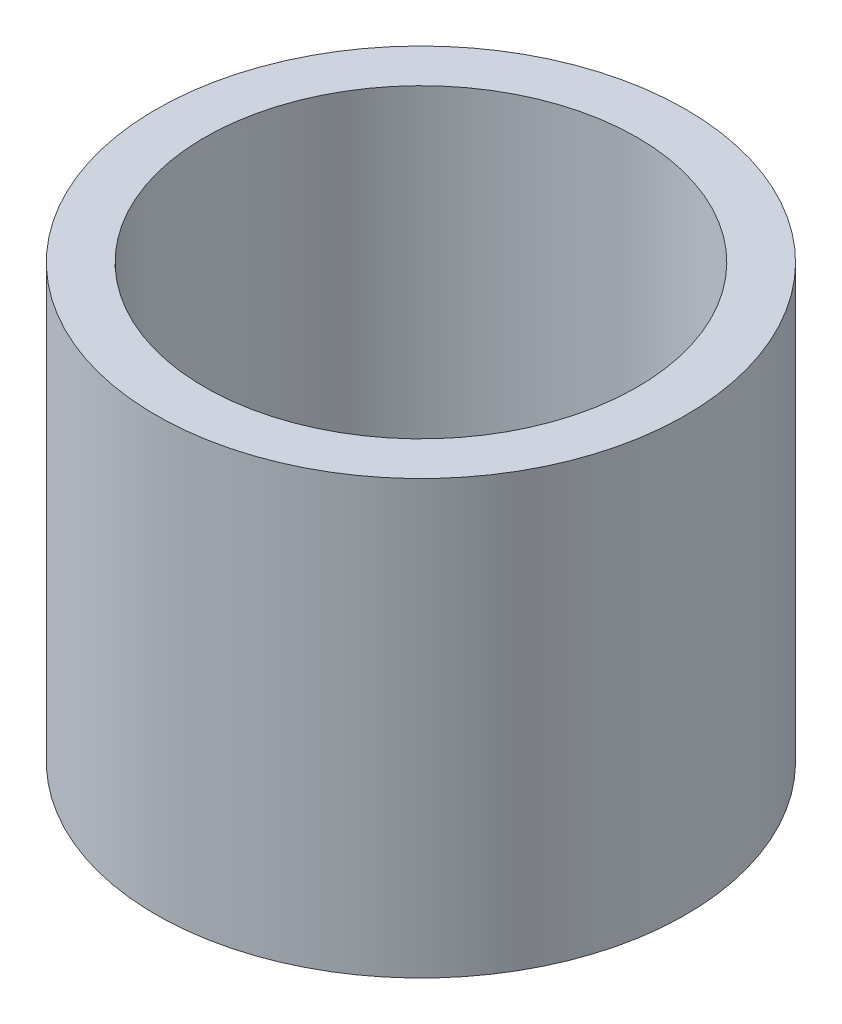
ISO-10303-21;
HEADER;
FILE_DESCRIPTION(('STEP AP214'),'2;1');
FILE_NAME('part.step','',(''),(''),'','','');
FILE_SCHEMA(('AUTOMOTIVE_DESIGN { 1 0 10303 214 1 1 1 1 }'));
ENDSEC;
DATA;
#1=APPLICATION_CONTEXT('core data for automotive mechanical design processes');
#2=APPLICATION_PROTOCOL_DEFINITION('international standard','automotive_design',2000,#1);
#3=PRODUCT_CONTEXT('',#1,'mechanical');
#4=PRODUCT('Part','Part','',(#3));
#5=PRODUCT_RELATED_PRODUCT_CATEGORY('part','',(#4));
#6=PRODUCT_DEFINITION_FORMATION('','',#4);
#7=PRODUCT_DEFINITION_CONTEXT('part definition',#1,'design');
#8=PRODUCT_DEFINITION('design','',#6,#7);
#9=PRODUCT_DEFINITION_SHAPE('','',#8);
#10=(LENGTH_UNIT() NAMED_UNIT(*) SI_UNIT(.MILLI.,.METRE.));
#11=(NAMED_UNIT(*) PLANE_ANGLE_UNIT() SI_UNIT($,.RADIAN.));
#12=(NAMED_UNIT(*) SI_UNIT($,.STERADIAN.) SOLID_ANGLE_UNIT());
#13=UNCERTAINTY_MEASURE_WITH_UNIT(LENGTH_MEASURE(1.E-05),#10,'distance_accuracy_value','');
#14=(GEOMETRIC_REPRESENTATION_CONTEXT(3) GLOBAL_UNCERTAINTY_ASSIGNED_CONTEXT((#13)) GLOBAL_UNIT_ASSIGNED_CONTEXT((#10,
#11,#12)) REPRESENTATION_CONTEXT('',''));
#15=CARTESIAN_POINT('',(0.,0.,0.));
#16=DIRECTION('',(0.,0.,1.));
#17=DIRECTION('',(1.,0.,0.));
#18=AXIS2_PLACEMENT_3D('',#15,#16,#17);
#19=CARTESIAN_POINT('',(0.,56.515,0.));
#20=DIRECTION('',(0.,1.,0.));
#21=DIRECTION('',(0.,0.,1.));
#22=AXIS2_PLACEMENT_3D('',#19,#20,#21);
#23=PLANE('',#22);
#24=CARTESIAN_POINT('',(0.,56.515,0.));
#25=DIRECTION('',(0.,1.,0.));
#26=DIRECTION('',(0.,0.,1.));
#27=AXIS2_PLACEMENT_3D('',#24,#25,#26);
#28=CIRCLE('',#27,34.6075);
#29=CARTESIAN_POINT('',(0.,56.515,-34.6075));
#30=VERTEX_POINT('',#29);
#31=EDGE_CURVE('E10',#30,#30,#28,.T.);
#32=ORIENTED_EDGE('',*,*,#31,.T.);
#33=EDGE_LOOP('',(#32));
#34=FACE_BOUND('',#33,.T.);
#35=CARTESIAN_POINT('',(0.,56.515,0.));
#36=DIRECTION('',(0.,1.,0.));
#37=DIRECTION('',(0.,0.,1.));
#38=AXIS2_PLACEMENT_3D('',#35,#36,#37);
#39=CIRCLE('',#38,28.2575);
#40=CARTESIAN_POINT('',(0.,56.515,-28.2575));
#41=VERTEX_POINT('',#40);
#42=EDGE_CURVE('E56',#41,#41,#39,.T.);
#43=ORIENTED_EDGE('',*,*,#42,.F.);
#44=EDGE_LOOP('',(#43));
#45=FACE_BOUND('',#44,.T.);
#46=ADVANCED_FACE('F43',(#34,#45),#23,.T.);
#47=CARTESIAN_POINT('',(0.,0.,0.));
#48=DIRECTION('',(0.,1.,0.));
#49=DIRECTION('',(0.,0.,1.));
#50=AXIS2_PLACEMENT_3D('',#47,#48,#49);
#51=PLANE('',#50);
#52=CARTESIAN_POINT('',(0.,0.,0.));
#53=DIRECTION('',(0.,1.,0.));
#54=DIRECTION('',(0.,0.,1.));
#55=AXIS2_PLACEMENT_3D('',#52,#53,#54);
#56=CIRCLE('',#55,34.6075);
#57=CARTESIAN_POINT('',(0.,0.,-34.6075));
#58=VERTEX_POINT('',#57);
#59=EDGE_CURVE('E47',#58,#58,#56,.T.);
#60=ORIENTED_EDGE('',*,*,#59,.F.);
#61=EDGE_LOOP('',(#60));
#62=FACE_BOUND('',#61,.T.);
#63=CARTESIAN_POINT('',(0.,0.,0.));
#64=DIRECTION('',(0.,1.,0.));
#65=DIRECTION('',(0.,0.,1.));
#66=AXIS2_PLACEMENT_3D('',#63,#64,#65);
#67=CIRCLE('',#66,28.2575);
#68=CARTESIAN_POINT('',(0.,0.,-28.2575));
#69=VERTEX_POINT('',#68);
#70=EDGE_CURVE('E58',#69,#69,#67,.T.);
#71=ORIENTED_EDGE('',*,*,#70,.T.);
#72=EDGE_LOOP('',(#71));
#73=FACE_BOUND('',#72,.T.);
#74=ADVANCED_FACE('F70',(#62,#73),#51,.F.);
#75=CARTESIAN_POINT('',(0.,56.515,0.));
#76=DIRECTION('',(0.,-1.,0.));
#77=DIRECTION('',(0.,0.,-1.));
#78=AXIS2_PLACEMENT_3D('',#75,#76,#77);
#79=CYLINDRICAL_SURFACE('',#78,34.6075);
#80=CARTESIAN_POINT('',(0.,56.515,-34.6075));
#81=CARTESIAN_POINT('',(0.,55.9263020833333,-34.6075));
#82=CARTESIAN_POINT('',(0.,55.3376041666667,-34.6075));
#83=CARTESIAN_POINT('',(0.,54.1602083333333,-34.6075));
#84=CARTESIAN_POINT('',(0.,53.5715104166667,-34.6075));
#85=CARTESIAN_POINT('',(0.,52.3941145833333,-34.6075));
#86=CARTESIAN_POINT('',(0.,51.8054166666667,-34.6075));
#87=CARTESIAN_POINT('',(0.,50.6280208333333,-34.6075));
#88=CARTESIAN_POINT('',(0.,50.0393229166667,-34.6075));
#89=CARTESIAN_POINT('',(0.,48.8619270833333,-34.6075));
#90=CARTESIAN_POINT('',(0.,48.2732291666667,-34.6075));
#91=CARTESIAN_POINT('',(0.,47.0958333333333,-34.6075));
#92=CARTESIAN_POINT('',(0.,46.5071354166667,-34.6075));
#93=CARTESIAN_POINT('',(0.,45.3297395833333,-34.6075));
#94=CARTESIAN_POINT('',(0.,44.7410416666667,-34.6075));
#95=CARTESIAN_POINT('',(0.,43.5636458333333,-34.6075));
#96=CARTESIAN_POINT('',(0.,42.9749479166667,-34.6075));
#97=CARTESIAN_POINT('',(0.,41.7975520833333,-34.6075));
#98=CARTESIAN_POINT('',(0.,41.2088541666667,-34.6075));
#99=CARTESIAN_POINT('',(0.,40.0314583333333,-34.6075));
#100=CARTESIAN_POINT('',(0.,39.4427604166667,-34.6075));
#101=CARTESIAN_POINT('',(0.,38.2653645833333,-34.6075));
#102=CARTESIAN_POINT('',(0.,37.6766666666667,-34.6075));
#103=CARTESIAN_POINT('',(0.,36.4992708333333,-34.6075));
#104=CARTESIAN_POINT('',(0.,35.9105729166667,-34.6075));
#105=CARTESIAN_POINT('',(0.,34.7331770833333,-34.6075));
#106=CARTESIAN_POINT('',(0.,34.1444791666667,-34.6075));
#107=CARTESIAN_POINT('',(0.,32.9670833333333,-34.6075));
#108=CARTESIAN_POINT('',(0.,32.3783854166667,-34.6075));
#109=CARTESIAN_POINT('',(0.,31.2009895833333,-34.6075));
#110=CARTESIAN_POINT('',(0.,30.6122916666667,-34.6075));
#111=CARTESIAN_POINT('',(0.,29.4348958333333,-34.6075));
#112=CARTESIAN_POINT('',(0.,28.8461979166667,-34.6075));
#113=CARTESIAN_POINT('',(0.,27.6688020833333,-34.6075));
#114=CARTESIAN_POINT('',(0.,27.0801041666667,-34.6075));
#115=CARTESIAN_POINT('',(0.,25.9027083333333,-34.6075));
#116=CARTESIAN_POINT('',(0.,25.3140104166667,-34.6075));
#117=CARTESIAN_POINT('',(0.,24.1366145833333,-34.6075));
#118=CARTESIAN_POINT('',(0.,23.5479166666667,-34.6075));
#119=CARTESIAN_POINT('',(0.,22.3705208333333,-34.6075));
#120=CARTESIAN_POINT('',(0.,21.7818229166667,-34.6075));
#121=CARTESIAN_POINT('',(0.,20.6044270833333,-34.6075));
#122=CARTESIAN_POINT('',(0.,20.0157291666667,-34.6075));
#123=CARTESIAN_POINT('',(0.,18.8383333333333,-34.6075));
#124=CARTESIAN_POINT('',(0.,18.2496354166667,-34.6075));
#125=CARTESIAN_POINT('',(0.,17.0722395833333,-34.6075));
#126=CARTESIAN_POINT('',(0.,16.4835416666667,-34.6075));
#127=CARTESIAN_POINT('',(0.,15.3061458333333,-34.6075));
#128=CARTESIAN_POINT('',(0.,14.7174479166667,-34.6075));
#129=CARTESIAN_POINT('',(0.,13.5400520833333,-34.6075));
#130=CARTESIAN_POINT('',(0.,12.9513541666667,-34.6075));
#131=CARTESIAN_POINT('',(0.,11.7739583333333,-34.6075));
#132=CARTESIAN_POINT('',(0.,11.1852604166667,-34.6075));
#133=CARTESIAN_POINT('',(0.,10.0078645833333,-34.6075));
#134=CARTESIAN_POINT('',(0.,9.41916666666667,-34.6075));
#135=CARTESIAN_POINT('',(0.,8.24177083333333,-34.6075));
#136=CARTESIAN_POINT('',(0.,7.65307291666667,-34.6075));
#137=CARTESIAN_POINT('',(0.,6.47567708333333,-34.6075));
#138=CARTESIAN_POINT('',(0.,5.88697916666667,-34.6075));
#139=CARTESIAN_POINT('',(0.,4.70958333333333,-34.6075));
#140=CARTESIAN_POINT('',(0.,4.12088541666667,-34.6075));
#141=CARTESIAN_POINT('',(0.,2.94348958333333,-34.6075));
#142=CARTESIAN_POINT('',(0.,2.35479166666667,-34.6075));
#143=CARTESIAN_POINT('',(0.,1.17739583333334,-34.6075));
#144=CARTESIAN_POINT('',(0.,0.588697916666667,-34.6075));
#145=CARTESIAN_POINT('',(0.,0.,-34.6075));
#146=B_SPLINE_CURVE_WITH_KNOTS('',3,(#80,#81,#82,#83,#84,#85,#86,#87,#88,#89,#90,#91,#92,#93,
#94,#95,#96,#97,#98,#99,#100,#101,#102,#103,#104,#105,#106,#107,#108,#109,#110,#111,#112,#113,
#114,#115,#116,#117,#118,#119,#120,#121,#122,#123,#124,#125,#126,#127,#128,#129,#130,#131,#132,
#133,#134,#135,#136,#137,#138,#139,#140,#141,#142,#143,#144,#145),.UNSPECIFIED.,.F.,.F.,(4,2,2,
2,2,2,2,2,2,2,2,2,2,2,2,2,2,2,2,2,2,2,2,2,2,2,2,2,2,2,2,2,4),(0.,1.76609375,3.5321875,
5.29828125,7.064375,8.83046874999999,10.5965625,12.36265625,14.12875,15.89484375,17.6609375,
19.42703125,21.193125,22.95921875,24.7253125,26.49140625,28.2575,30.02359375,31.7896875,
33.55578125,35.321875,37.08796875,38.8540625,40.62015625,42.38625,44.15234375,45.9184375,
47.68453125,49.450625,51.21671875,52.9828125,54.74890625,56.515),.UNSPECIFIED.);
#147=EDGE_CURVE('BSEAM45',#30,#58,#146,.T.);
#148=ORIENTED_EDGE('',*,*,#31,.F.);
#149=ORIENTED_EDGE('',*,*,#59,.T.);
#150=ORIENTED_EDGE('',*,*,#147,.T.);
#151=ORIENTED_EDGE('',*,*,#147,.F.);
#152=EDGE_LOOP('',(#148,#150,#149,#151));
#153=FACE_BOUND('',#152,.T.);
#154=ADVANCED_FACE('F45',(#153),#79,.T.);
#155=CARTESIAN_POINT('',(0.,56.515,0.));
#156=DIRECTION('',(0.,-1.,0.));
#157=DIRECTION('',(0.,0.,-1.));
#158=AXIS2_PLACEMENT_3D('',#155,#156,#157);
#159=CYLINDRICAL_SURFACE('',#158,28.2575);
#160=CARTESIAN_POINT('',(0.,56.515,-28.2575));
#161=CARTESIAN_POINT('',(0.,55.9263020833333,-28.2575));
#162=CARTESIAN_POINT('',(0.,55.3376041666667,-28.2575));
#163=CARTESIAN_POINT('',(0.,54.1602083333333,-28.2575));
#164=CARTESIAN_POINT('',(0.,53.5715104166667,-28.2575));
#165=CARTESIAN_POINT('',(0.,52.3941145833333,-28.2575));
#166=CARTESIAN_POINT('',(0.,51.8054166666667,-28.2575));
#167=CARTESIAN_POINT('',(0.,50.6280208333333,-28.2575));
#168=CARTESIAN_POINT('',(0.,50.0393229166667,-28.2575));
#169=CARTESIAN_POINT('',(0.,48.8619270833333,-28.2575));
#170=CARTESIAN_POINT('',(0.,48.2732291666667,-28.2575));
#171=CARTESIAN_POINT('',(0.,47.0958333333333,-28.2575));
#172=CARTESIAN_POINT('',(0.,46.5071354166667,-28.2575));
#173=CARTESIAN_POINT('',(0.,45.3297395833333,-28.2575));
#174=CARTESIAN_POINT('',(0.,44.7410416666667,-28.2575));
#175=CARTESIAN_POINT('',(0.,43.5636458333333,-28.2575));
#176=CARTESIAN_POINT('',(0.,42.9749479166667,-28.2575));
#177=CARTESIAN_POINT('',(0.,41.7975520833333,-28.2575));
#178=CARTESIAN_POINT('',(0.,41.2088541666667,-28.2575));
#179=CARTESIAN_POINT('',(0.,40.0314583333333,-28.2575));
#180=CARTESIAN_POINT('',(0.,39.4427604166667,-28.2575));
#181=CARTESIAN_POINT('',(0.,38.2653645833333,-28.2575));
#182=CARTESIAN_POINT('',(0.,37.6766666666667,-28.2575));
#183=CARTESIAN_POINT('',(0.,36.4992708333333,-28.2575));
#184=CARTESIAN_POINT('',(0.,35.9105729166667,-28.2575));
#185=CARTESIAN_POINT('',(0.,34.7331770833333,-28.2575));
#186=CARTESIAN_POINT('',(0.,34.1444791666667,-28.2575));
#187=CARTESIAN_POINT('',(0.,32.9670833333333,-28.2575));
#188=CARTESIAN_POINT('',(0.,32.3783854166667,-28.2575));
#189=CARTESIAN_POINT('',(0.,31.2009895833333,-28.2575));
#190=CARTESIAN_POINT('',(0.,30.6122916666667,-28.2575));
#191=CARTESIAN_POINT('',(0.,29.4348958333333,-28.2575));
#192=CARTESIAN_POINT('',(0.,28.8461979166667,-28.2575));
#193=CARTESIAN_POINT('',(0.,27.6688020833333,-28.2575));
#194=CARTESIAN_POINT('',(0.,27.0801041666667,-28.2575));
#195=CARTESIAN_POINT('',(0.,25.9027083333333,-28.2575));
#196=CARTESIAN_POINT('',(0.,25.3140104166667,-28.2575));
#197=CARTESIAN_POINT('',(0.,24.1366145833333,-28.2575));
#198=CARTESIAN_POINT('',(0.,23.5479166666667,-28.2575));
#199=CARTESIAN_POINT('',(0.,22.3705208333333,-28.2575));
#200=CARTESIAN_POINT('',(0.,21.7818229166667,-28.2575));
#201=CARTESIAN_POINT('',(0.,20.6044270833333,-28.2575));
#202=CARTESIAN_POINT('',(0.,20.0157291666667,-28.2575));
#203=CARTESIAN_POINT('',(0.,18.8383333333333,-28.2575));
#204=CARTESIAN_POINT('',(0.,18.2496354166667,-28.2575));
#205=CARTESIAN_POINT('',(0.,17.0722395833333,-28.2575));
#206=CARTESIAN_POINT('',(0.,16.4835416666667,-28.2575));
#207=CARTESIAN_POINT('',(0.,15.3061458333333,-28.2575));
#208=CARTESIAN_POINT('',(0.,14.7174479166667,-28.2575));
#209=CARTESIAN_POINT('',(0.,13.5400520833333,-28.2575));
#210=CARTESIAN_POINT('',(0.,12.9513541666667,-28.2575));
#211=CARTESIAN_POINT('',(0.,11.7739583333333,-28.2575));
#212=CARTESIAN_POINT('',(0.,11.1852604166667,-28.2575));
#213=CARTESIAN_POINT('',(0.,10.0078645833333,-28.2575));
#214=CARTESIAN_POINT('',(0.,9.41916666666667,-28.2575));
#215=CARTESIAN_POINT('',(0.,8.24177083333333,-28.2575));
#216=CARTESIAN_POINT('',(0.,7.65307291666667,-28.2575));
#217=CARTESIAN_POINT('',(0.,6.47567708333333,-28.2575));
#218=CARTESIAN_POINT('',(0.,5.88697916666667,-28.2575));
#219=CARTESIAN_POINT('',(0.,4.70958333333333,-28.2575));
#220=CARTESIAN_POINT('',(0.,4.12088541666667,-28.2575));
#221=CARTESIAN_POINT('',(0.,2.94348958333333,-28.2575));
#222=CARTESIAN_POINT('',(0.,2.35479166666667,-28.2575));
#223=CARTESIAN_POINT('',(0.,1.17739583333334,-28.2575));
#224=CARTESIAN_POINT('',(0.,0.588697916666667,-28.2575));
#225=CARTESIAN_POINT('',(0.,0.,-28.2575));
#226=B_SPLINE_CURVE_WITH_KNOTS('',3,(#160,#161,#162,#163,#164,#165,#166,#167,#168,#169,#170,
#171,#172,#173,#174,#175,#176,#177,#178,#179,#180,#181,#182,#183,#184,#185,#186,#187,#188,#189,
#190,#191,#192,#193,#194,#195,#196,#197,#198,#199,#200,#201,#202,#203,#204,#205,#206,#207,#208,
#209,#210,#211,#212,#213,#214,#215,#216,#217,#218,#219,#220,#221,#222,#223,#224,#225),
.UNSPECIFIED.,.F.,.F.,(4,2,2,2,2,2,2,2,2,2,2,2,2,2,2,2,2,2,2,2,2,2,2,2,2,2,2,2,2,2,2,2,4),(0.,
1.76609375,3.53218750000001,5.29828125,7.064375,8.83046875,10.5965625,12.36265625,14.12875,
15.89484375,17.6609375,19.42703125,21.193125,22.95921875,24.7253125,26.49140625,28.2575,
30.02359375,31.7896875,33.55578125,35.321875,37.08796875,38.8540625,40.62015625,42.38625,
44.15234375,45.9184375,47.68453125,49.450625,51.21671875,52.9828125,54.74890625,56.515),.UNSPECIFIED.);
#227=EDGE_CURVE('BSEAM66',#41,#69,#226,.T.);
#228=ORIENTED_EDGE('',*,*,#42,.T.);
#229=ORIENTED_EDGE('',*,*,#70,.F.);
#230=ORIENTED_EDGE('',*,*,#227,.T.);
#231=ORIENTED_EDGE('',*,*,#227,.F.);
#232=EDGE_LOOP('',(#228,#230,#229,#231));
#233=FACE_BOUND('',#232,.T.);
#234=ADVANCED_FACE('F66',(#233),#159,.F.);
#235=CLOSED_SHELL('',(#46,#74,#154,#234));
#236=MANIFOLD_SOLID_BREP('B2',#235);
#237=ADVANCED_BREP_SHAPE_REPRESENTATION('',(#18,#236),#14);
#238=SHAPE_DEFINITION_REPRESENTATION(#9,#237);
ENDSEC;
END-ISO-10303-21;
